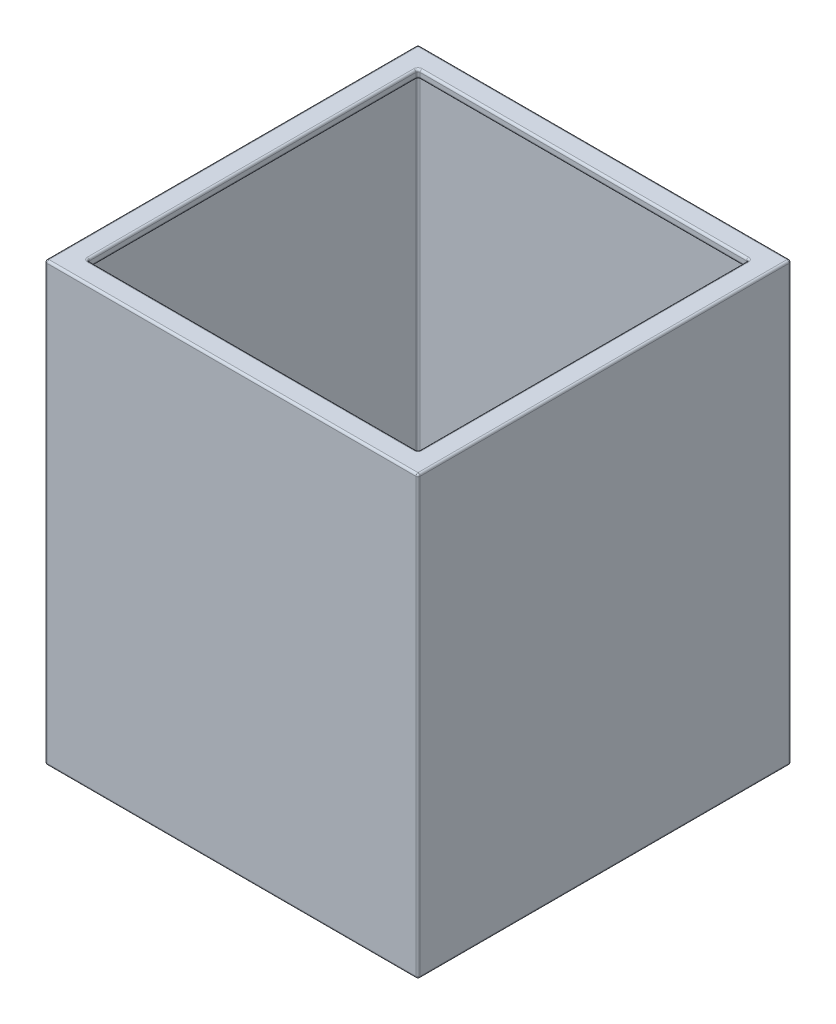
from build123d import *

# Parameters (mm, degrees)
SKETCH1_W           = 111.125
SKETCH1_H           = 111.125
BOSS_EXTRUDE1_DEPTH = 130.175
SKETCH2_W           = 98.425
SKETCH2_H           = 98.425
CUT_EXTRUDE1_DEPTH  = 127.635
SKETCH3_W           = 106.045
SKETCH3_H           = 106.045
CUT_EXTRUDE2_DEPTH  = 125.095
FILLET1_R           = 0.635


with BuildPart() as part:
    # Sketch1 → Boss-Extrude1 (new body)
    with BuildSketch(Plane(origin=(0, 0, 0), x_dir=(1, 0, 0), z_dir=(0, 1, 0))):
        with Locations((55.5625, 55.5625)):
            Rectangle(SKETCH1_W, SKETCH1_H)
    extrude(amount=BOSS_EXTRUDE1_DEPTH)

    # Sketch2 → Cut-Extrude1 (cut)
    with BuildSketch(Plane(origin=(0, 130.175, 0), x_dir=(1, 0, 0), z_dir=(0, 1, 0))):
        with Locations((55.5625, 55.5625)):
            Rectangle(SKETCH2_W, SKETCH2_H)
    extrude(amount=-CUT_EXTRUDE1_DEPTH, mode=Mode.SUBTRACT)

    # Sketch3 → Cut-Extrude2 (cut)
    with BuildSketch(Plane(origin=(0, 2.54, 0), x_dir=(1, 0, 0), z_dir=(0, 1, 0))):
        with Locations((55.5625, 55.5625)):
            Rectangle(SKETCH3_W, SKETCH3_H)
    extrude(amount=CUT_EXTRUDE2_DEPTH, mode=Mode.SUBTRACT)

    # Fillet1
    fillet1_edges = [part.edges().sort_by_distance(p)[0] for p in [
        (111.125, 130.175, -55.5625),
        (55.5625, 130.175, -104.775),
        (55.5625, 130.175, -111.125),
        (6.35, 130.175, -55.5625),
        (55.5625, 130.175, -6.35),
        (104.775, 130.175, -55.5625),
        (104.775, 128.905, -104.775),
        (6.35, 128.905, -104.775),
        (55.5625, 127.635, -104.775),
        (104.775, 128.905, -6.35),
        (6.35, 128.905, -6.35),
        (108.585, 127.635, -55.5625),
        (108.585, 65.0875, -2.54),
        (108.585, 2.54, -55.5625),
        (55.5625, 127.635, -2.54),
        (2.54, 65.0875, -2.54),
        (55.5625, 2.54, -2.54),
        (2.54, 127.635, -55.5625),
        (2.54, 65.0875, -108.585),
        (2.54, 2.54, -55.5625),
        (55.5625, 127.635, -108.585),
        (108.585, 65.0875, -108.585),
        (55.5625, 2.54, -108.585),
        (6.35, 127.635, -55.5625),
        (55.5625, 127.635, -6.35),
        (104.775, 127.635, -55.5625),
        (0, 130.175, -55.5625),
        (55.5625, 0, -111.125),
        (111.125, 0, -55.5625),
        (55.5625, 0, 0),
        (0, 0, -55.5625),
        (0, 65.0875, -111.125),
        (111.125, 65.0875, -111.125),
        (111.125, 65.0875, 0),
        (0, 65.0875, 0),
        (55.5625, 130.175, 0),
    ]]
    fillet(fillet1_edges, radius=FILLET1_R)


solid = part.part
